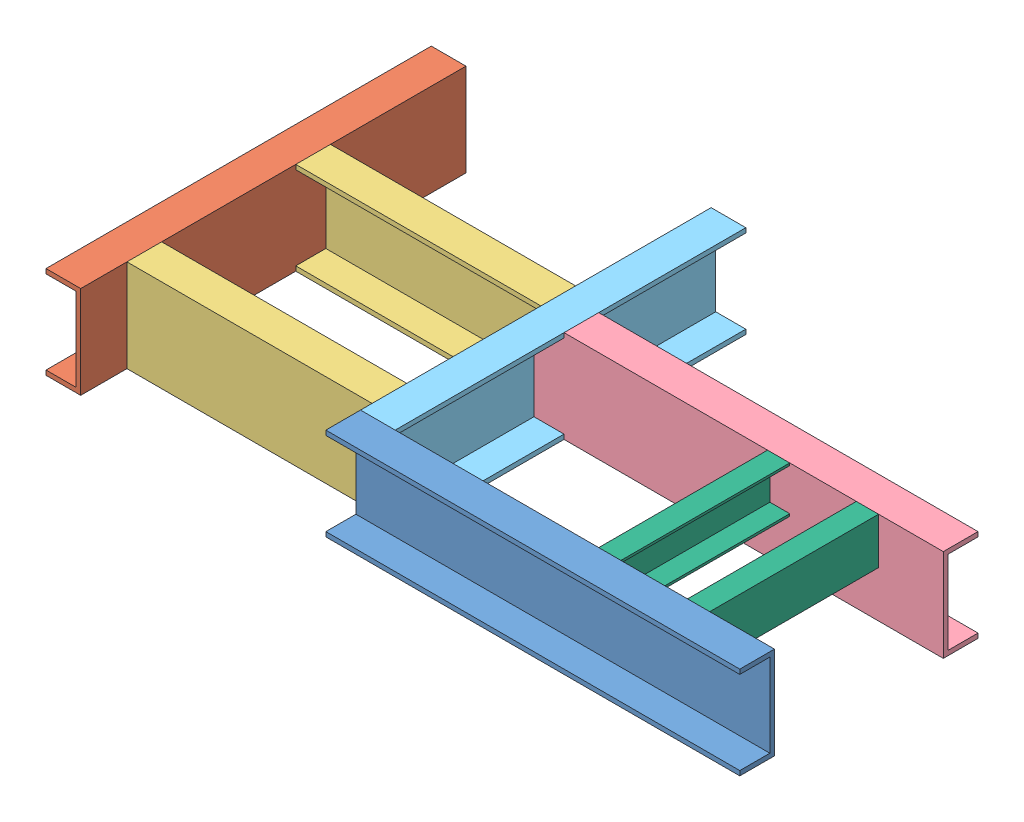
SolidWorks assembly 10YSQ-00-00N.SLDASM, configuration Default (file format 9000). Lengths in mm.
Overall size (1500 200 833).
8 component instances, 6 part files, 24 mates.
Components (placement in the parent):
- 10YSQ-00-14N-1: 10YSQ-00-14N.SLDPRT [Default] at (464.9314 499.9613 815.8423) x (0 0 1) z (-1 0 0) size (75 200 895)
- 10YSQ-00-15N-1: 10YSQ-00-15N.SLDPRT [Default] at (-512.5686 699.9613 474.3423) x (-1 0 0) z (0 0 1) size (75 200 833)
- 10YSQ-00-1N-1: 10YSQ-00-1N.SLDPRT [Default] at (-247.5686 699.9613 790.8423) x (0 0 -1) z (-1 0 0) size (75 200 530)
- 10YSQ-00-16N-4N-2: 10YSQ-00-16N-4N.SLDPRT [Default] at (464.9314 499.9613 450.8423) x (0 0 -1) z (1 0 0) size (75 200 895)
- 10YSQ-00-17-4N-2: 10YSQ-00-17-4N.SLDPRT [Default] at (17.4314 499.9613 436.8423) size (75 200 758)
- 10YSQ-00-1N-2: 10YSQ-00-1N.SLDPRT [Default] at (-247.5686 499.9613 350.8423) x (0 0 1) z (-1 0 0) size (75 200 530)
- 10YSQ-00-06N-2: 10YSQ-00-06N.SLDPRT [Default] at (532.4314 599.9613 633.3423) size (48 100 365)
- 10YSQ-00-06N-3: 10YSQ-00-06N.SLDPRT [Default] at (772.4314 599.9613 633.3423) x (-1 0 0) z (0 0 -1) size (48 100 365)
Mates (geometry in assembly coordinates):
- Coincident2: coincident aligned: plane of ? through (720.2181 824.9879 696.5527) normal (0 1 0); plane of 10YSQ-00-14N-1 through (-126.7819 824.9879 696.5527) normal (0 1 0)
- Coincident4: coincident aligned: plane of 10YSQ-00-14N-1 through (17.4314 699.9613 815.8423) normal (0 1 0); plane of 10YSQ-00-15N-1 through (-587.5686 699.9613 890.8423) normal (0 1 0)
- Coincident12: coincident aligned: plane of 10YSQ-00-15N-1 through (-512.5686 499.9613 890.8423) normal (0 -1 0); plane of 10YSQ-00-1N-1 through (-512.5686 499.9613 790.8423) normal (0 -1 0)
- Coincident13: coincident aligned: plane of 10YSQ-00-14N-1 through (17.4314 699.9613 815.8423) normal (0 1 0); plane of 10YSQ-00-16N-4N-2 through (912.4314 699.9613 450.8423) normal (0 1 0)
- Coincident29: coincident aligned: plane of 10YSQ-00-16N-4N-2 through (912.4314 699.9613 450.8423) normal (0 1 0); plane of 10YSQ-00-17-4N-2 through (17.4314 699.9613 815.8423) normal (0 1 0)
- Coincident34: coincident aligned: plane of 10YSQ-00-14N-1 through (17.4314 499.9613 815.8423) normal (-1 0 0); plane of 10YSQ-00-17-4N-2 through (17.4314 499.9613 815.8423) normal (-1 0 0)
- Coincident38: coincident anti-aligned: plane of 10YSQ-00-1N-1 through (17.4314 699.9613 790.8423) normal (1 0 0); plane of 10YSQ-00-17-4N-2 through (17.4314 499.9613 815.8423) normal (-1 0 0)
- Coincident39: coincident anti-aligned: plane of 10YSQ-00-15N-1 through (-512.5686 699.9613 890.8423) normal (1 0 0); plane of 10YSQ-00-1N-1 through (-512.5686 699.9613 790.8423) normal (-1 0 0)
- Coincident40: coincident aligned: plane of 10YSQ-00-14N-1 through (17.4314 699.9613 890.8423) normal (0 0 1); plane of 10YSQ-00-15N-1 through (-512.5686 699.9613 890.8423) normal (0 0 1)
- Coincident41: coincident aligned: plane of 10YSQ-00-17-4N-2 through (92.4314 499.9613 815.8423) normal (0 -1 0); plane of 10YSQ-00-1N-2 through (-512.5686 499.9613 425.8423) normal (0 -1 0)
- Distance2: distance = 440 mm anti-aligned: plane of 10YSQ-00-1N-2 through (-512.5686 499.9613 350.8423) normal (0 0 -1); plane of 10YSQ-00-1N-1 through (-512.5686 699.9613 790.8423) normal (0 0 1)
- Coincident43: coincident anti-aligned: plane of 10YSQ-00-15N-1 through (-512.5686 699.9613 890.8423) normal (1 0 0); plane of 10YSQ-00-1N-2 through (-512.5686 499.9613 350.8423) normal (-1 0 0)
- Distance3: distance = 100 mm aligned: plane of 10YSQ-00-1N-1 through (-512.5686 699.9613 790.8423) normal (0 0 1); plane of 10YSQ-00-14N-1 through (17.4314 699.9613 890.8423) normal (0 0 1)
- Coincident46: coincident anti-aligned: plane of ? through (720.2181 724.9879 331.5527) normal (0 0 -1); plane of 10YSQ-00-16N-4N-2 through (768.2181 624.9879 331.5527) normal (0 0 1)
- Coincident48: coincident anti-aligned: plane of ? through (720.2181 724.9879 696.5527) normal (0 0 1); plane of 10YSQ-00-14N-1 through (-126.7819 624.9879 696.5527) normal (0 0 -1)
- Coincident50: coincident aligned: plane of 10YSQ-00-16N-4N-2 through (912.4314 699.9613 450.8423) normal (0 1 0); plane of 10YSQ-00-06N-2 through (532.4314 699.9613 815.8423) normal (0 1 0)
- Coincident51: coincident anti-aligned: plane of 10YSQ-00-14N-1 through (17.4314 499.9613 815.8423) normal (0 0 -1); plane of 10YSQ-00-06N-2 through (532.4314 599.9613 815.8423) normal (0 0 1)
- Coincident53: coincident anti-aligned: plane of 10YSQ-00-16N-4N-2 through (912.4314 499.9613 450.8423) normal (0 0 1); plane of 10YSQ-00-06N-2 through (532.4314 599.9613 450.8423) normal (0 0 -1)
- Coincident54: coincident aligned: plane of 10YSQ-00-14N-1 through (912.4314 499.9613 815.8423) normal (1 0 0); plane of 10YSQ-00-16N-4N-2 through (912.4314 499.9613 450.8423) normal (1 0 0)
- Distance5: distance = 140 mm aligned: plane of 10YSQ-00-16N-4N-2 through (912.4314 499.9613 450.8423) normal (1 0 0); plane of 10YSQ-00-06N-3 through (772.4314 599.9613 450.8423) normal (1 0 0)
- Coincident56: coincident aligned: plane of 10YSQ-00-16N-4N-2 through (912.4314 699.9613 450.8423) normal (0 1 0); plane of 10YSQ-00-06N-3 through (772.4314 699.9613 450.8423) normal (0 1 0)
- Coincident57: coincident anti-aligned: plane of 10YSQ-00-16N-4N-2 through (912.4314 499.9613 450.8423) normal (0 0 1); plane of 10YSQ-00-06N-3 through (772.4314 599.9613 450.8423) normal (0 0 -1)
- Distance6: distance = 240 mm anti-aligned: plane of 10YSQ-00-06N-2 through (532.4314 599.9613 815.8423) normal (-1 0 0); plane of 10YSQ-00-06N-3 through (772.4314 599.9613 450.8423) normal (1 0 0)
- Coincident59: coincident anti-aligned: plane of 10YSQ-00-14N-1 through (17.4314 499.9613 815.8423) normal (0 0 -1); plane of 10YSQ-00-17-4N-2 through (17.4314 499.9613 815.8423) normal (0 0 1)
